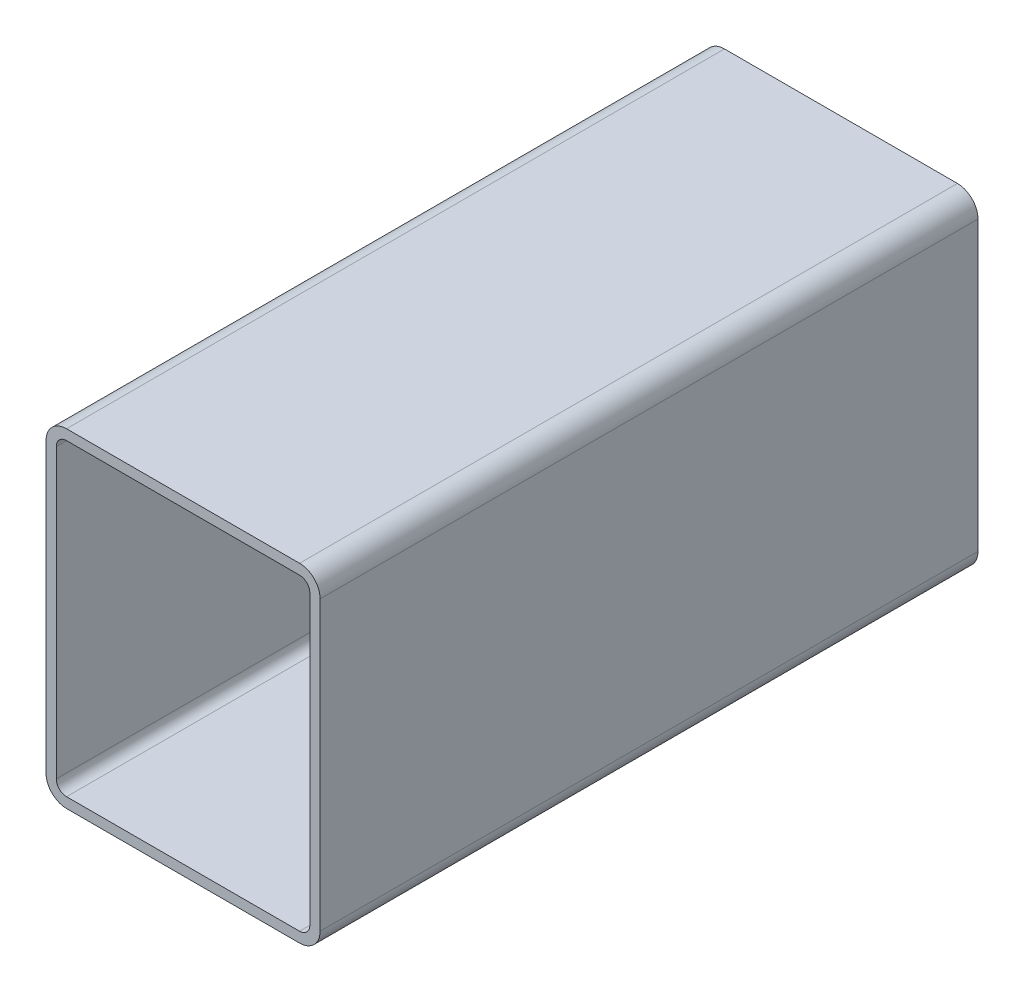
ISO-10303-21;
HEADER;
FILE_DESCRIPTION(('STEP AP214'),'2;1');
FILE_NAME('part.step','',(''),(''),'','','');
FILE_SCHEMA(('AUTOMOTIVE_DESIGN { 1 0 10303 214 1 1 1 1 }'));
ENDSEC;
DATA;
#1=APPLICATION_CONTEXT('core data for automotive mechanical design processes');
#2=APPLICATION_PROTOCOL_DEFINITION('international standard','automotive_design',2000,#1);
#3=PRODUCT_CONTEXT('',#1,'mechanical');
#4=PRODUCT('Part','Part','',(#3));
#5=PRODUCT_RELATED_PRODUCT_CATEGORY('part','',(#4));
#6=PRODUCT_DEFINITION_FORMATION('','',#4);
#7=PRODUCT_DEFINITION_CONTEXT('part definition',#1,'design');
#8=PRODUCT_DEFINITION('design','',#6,#7);
#9=PRODUCT_DEFINITION_SHAPE('','',#8);
#10=(LENGTH_UNIT() NAMED_UNIT(*) SI_UNIT(.MILLI.,.METRE.));
#11=(NAMED_UNIT(*) PLANE_ANGLE_UNIT() SI_UNIT($,.RADIAN.));
#12=(NAMED_UNIT(*) SI_UNIT($,.STERADIAN.) SOLID_ANGLE_UNIT());
#13=UNCERTAINTY_MEASURE_WITH_UNIT(LENGTH_MEASURE(1.E-05),#10,'distance_accuracy_value','');
#14=(GEOMETRIC_REPRESENTATION_CONTEXT(3) GLOBAL_UNCERTAINTY_ASSIGNED_CONTEXT((#13)) GLOBAL_UNIT_ASSIGNED_CONTEXT((#10,
#11,#12)) REPRESENTATION_CONTEXT('',''));
#15=CARTESIAN_POINT('',(0.,0.,0.));
#16=DIRECTION('',(0.,0.,1.));
#17=DIRECTION('',(1.,0.,0.));
#18=AXIS2_PLACEMENT_3D('',#15,#16,#17);
#19=CARTESIAN_POINT('',(10.3862396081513,144.886948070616,304.8));
#20=DIRECTION('',(0.,0.,1.));
#21=DIRECTION('',(1.,0.,0.));
#22=AXIS2_PLACEMENT_3D('',#19,#20,#21);
#23=PLANE('',#22);
#24=CARTESIAN_POINT('',(10.3862396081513,144.886948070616,304.8));
#25=DIRECTION('',(0.,0.,1.));
#26=DIRECTION('',(1.,0.,0.));
#27=AXIS2_PLACEMENT_3D('',#24,#25,#26);
#28=CIRCLE('',#27,9.52500000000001);
#29=CARTESIAN_POINT('',(10.3862396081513,154.411948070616,304.8));
#30=VERTEX_POINT('',#29);
#31=CARTESIAN_POINT('',(0.8612396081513,144.886948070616,304.8));
#32=VERTEX_POINT('',#31);
#33=EDGE_CURVE('E211',#30,#32,#28,.T.);
#34=ORIENTED_EDGE('',*,*,#33,.T.);
#35=DIRECTION('',(0.,-1.,0.));
#36=VECTOR('',#35,1.);
#37=CARTESIAN_POINT('',(0.8612396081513,11.5369480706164,304.8));
#38=LINE('',#37,#36);
#39=CARTESIAN_POINT('',(0.861239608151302,11.5369480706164,304.8));
#40=VERTEX_POINT('',#39);
#41=EDGE_CURVE('E214',#32,#40,#38,.T.);
#42=ORIENTED_EDGE('',*,*,#41,.T.);
#43=CARTESIAN_POINT('',(10.3862396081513,11.5369480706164,304.8));
#44=DIRECTION('',(0.,0.,1.));
#45=DIRECTION('',(1.,0.,0.));
#46=AXIS2_PLACEMENT_3D('',#43,#44,#45);
#47=CIRCLE('',#46,9.525);
#48=CARTESIAN_POINT('',(10.3862396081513,2.01194807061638,304.8));
#49=VERTEX_POINT('',#48);
#50=EDGE_CURVE('E217',#40,#49,#47,.T.);
#51=ORIENTED_EDGE('',*,*,#50,.T.);
#52=DIRECTION('',(1.,0.,0.));
#53=VECTOR('',#52,1.);
#54=CARTESIAN_POINT('',(118.336239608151,2.01194807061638,304.8));
#55=LINE('',#54,#53);
#56=CARTESIAN_POINT('',(118.336239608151,2.01194807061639,304.8));
#57=VERTEX_POINT('',#56);
#58=EDGE_CURVE('E219',#49,#57,#55,.T.);
#59=ORIENTED_EDGE('',*,*,#58,.T.);
#60=CARTESIAN_POINT('',(118.336239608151,11.5369480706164,304.8));
#61=DIRECTION('',(0.,0.,1.));
#62=DIRECTION('',(1.,0.,0.));
#63=AXIS2_PLACEMENT_3D('',#60,#61,#62);
#64=CIRCLE('',#63,9.525);
#65=CARTESIAN_POINT('',(127.861239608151,11.5369480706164,304.8));
#66=VERTEX_POINT('',#65);
#67=EDGE_CURVE('E221',#57,#66,#64,.T.);
#68=ORIENTED_EDGE('',*,*,#67,.T.);
#69=DIRECTION('',(0.,1.,0.));
#70=VECTOR('',#69,1.);
#71=CARTESIAN_POINT('',(127.861239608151,144.886948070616,304.8));
#72=LINE('',#71,#70);
#73=CARTESIAN_POINT('',(127.861239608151,144.886948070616,304.8));
#74=VERTEX_POINT('',#73);
#75=EDGE_CURVE('E223',#66,#74,#72,.T.);
#76=ORIENTED_EDGE('',*,*,#75,.T.);
#77=CARTESIAN_POINT('',(118.336239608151,144.886948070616,304.8));
#78=DIRECTION('',(0.,0.,1.));
#79=DIRECTION('',(1.,0.,0.));
#80=AXIS2_PLACEMENT_3D('',#77,#78,#79);
#81=CIRCLE('',#80,9.525);
#82=CARTESIAN_POINT('',(118.336239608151,154.411948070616,304.8));
#83=VERTEX_POINT('',#82);
#84=EDGE_CURVE('E225',#74,#83,#81,.T.);
#85=ORIENTED_EDGE('',*,*,#84,.T.);
#86=DIRECTION('',(-1.,0.,0.));
#87=VECTOR('',#86,1.);
#88=CARTESIAN_POINT('',(10.3862396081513,154.411948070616,304.8));
#89=LINE('',#88,#87);
#90=EDGE_CURVE('E227',#83,#30,#89,.T.);
#91=ORIENTED_EDGE('',*,*,#90,.T.);
#92=EDGE_LOOP('',(#34,#42,#51,#59,#68,#76,#85,#91));
#93=FACE_BOUND('',#92,.T.);
#94=DIRECTION('',(0.,-1.,0.));
#95=VECTOR('',#94,1.);
#96=CARTESIAN_POINT('',(5.6237396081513,11.5369480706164,304.8));
#97=LINE('',#96,#95);
#98=CARTESIAN_POINT('',(5.6237396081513,144.886948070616,304.8));
#99=VERTEX_POINT('',#98);
#100=CARTESIAN_POINT('',(5.6237396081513,11.5369480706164,304.8));
#101=VERTEX_POINT('',#100);
#102=EDGE_CURVE('E154',#99,#101,#97,.T.);
#103=ORIENTED_EDGE('',*,*,#102,.F.);
#104=CARTESIAN_POINT('',(10.3862396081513,144.886948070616,304.8));
#105=DIRECTION('',(0.,0.,1.));
#106=DIRECTION('',(1.,0.,0.));
#107=AXIS2_PLACEMENT_3D('',#104,#105,#106);
#108=CIRCLE('',#107,4.7625);
#109=CARTESIAN_POINT('',(10.3862396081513,149.649448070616,304.8));
#110=VERTEX_POINT('',#109);
#111=EDGE_CURVE('E146',#110,#99,#108,.T.);
#112=ORIENTED_EDGE('',*,*,#111,.F.);
#113=DIRECTION('',(-1.,0.,0.));
#114=VECTOR('',#113,1.);
#115=CARTESIAN_POINT('',(10.3862396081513,149.649448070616,304.8));
#116=LINE('',#115,#114);
#117=CARTESIAN_POINT('',(118.336239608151,149.649448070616,304.8));
#118=VERTEX_POINT('',#117);
#119=EDGE_CURVE('E179',#118,#110,#116,.T.);
#120=ORIENTED_EDGE('',*,*,#119,.F.);
#121=CARTESIAN_POINT('',(118.336239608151,144.886948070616,304.8));
#122=DIRECTION('',(0.,0.,1.));
#123=DIRECTION('',(1.,0.,0.));
#124=AXIS2_PLACEMENT_3D('',#121,#122,#123);
#125=CIRCLE('',#124,4.7625);
#126=CARTESIAN_POINT('',(123.098739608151,144.886948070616,304.8));
#127=VERTEX_POINT('',#126);
#128=EDGE_CURVE('E177',#127,#118,#125,.T.);
#129=ORIENTED_EDGE('',*,*,#128,.F.);
#130=DIRECTION('',(0.,1.,0.));
#131=VECTOR('',#130,1.);
#132=CARTESIAN_POINT('',(123.098739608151,144.886948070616,304.8));
#133=LINE('',#132,#131);
#134=CARTESIAN_POINT('',(123.098739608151,11.5369480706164,304.8));
#135=VERTEX_POINT('',#134);
#136=EDGE_CURVE('E175',#135,#127,#133,.T.);
#137=ORIENTED_EDGE('',*,*,#136,.F.);
#138=CARTESIAN_POINT('',(118.336239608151,11.5369480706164,304.8));
#139=DIRECTION('',(0.,0.,1.));
#140=DIRECTION('',(1.,0.,0.));
#141=AXIS2_PLACEMENT_3D('',#138,#139,#140);
#142=CIRCLE('',#141,4.7625);
#143=CARTESIAN_POINT('',(118.336239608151,6.77444807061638,304.8));
#144=VERTEX_POINT('',#143);
#145=EDGE_CURVE('E173',#144,#135,#142,.T.);
#146=ORIENTED_EDGE('',*,*,#145,.F.);
#147=DIRECTION('',(1.,0.,0.));
#148=VECTOR('',#147,1.);
#149=CARTESIAN_POINT('',(118.336239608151,6.77444807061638,304.8));
#150=LINE('',#149,#148);
#151=CARTESIAN_POINT('',(10.3862396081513,6.77444807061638,304.8));
#152=VERTEX_POINT('',#151);
#153=EDGE_CURVE('E169',#152,#144,#150,.T.);
#154=ORIENTED_EDGE('',*,*,#153,.F.);
#155=CARTESIAN_POINT('',(10.3862396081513,11.5369480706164,304.8));
#156=DIRECTION('',(0.,0.,1.));
#157=DIRECTION('',(1.,0.,0.));
#158=AXIS2_PLACEMENT_3D('',#155,#156,#157);
#159=CIRCLE('',#158,4.7625);
#160=EDGE_CURVE('E167',#101,#152,#159,.T.);
#161=ORIENTED_EDGE('',*,*,#160,.F.);
#162=EDGE_LOOP('',(#103,#112,#120,#129,#137,#146,#154,#161));
#163=FACE_BOUND('',#162,.T.);
#164=ADVANCED_FACE('F33',(#93,#163),#23,.T.);
#165=CARTESIAN_POINT('',(10.3862396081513,144.886948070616,0.));
#166=DIRECTION('',(0.,0.,1.));
#167=DIRECTION('',(1.,0.,0.));
#168=AXIS2_PLACEMENT_3D('',#165,#166,#167);
#169=PLANE('',#168);
#170=CARTESIAN_POINT('',(10.3862396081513,144.886948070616,0.));
#171=DIRECTION('',(0.,0.,1.));
#172=DIRECTION('',(1.,0.,0.));
#173=AXIS2_PLACEMENT_3D('',#170,#171,#172);
#174=CIRCLE('',#173,9.52500000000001);
#175=CARTESIAN_POINT('',(10.3862396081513,154.411948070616,0.));
#176=VERTEX_POINT('',#175);
#177=CARTESIAN_POINT('',(0.8612396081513,144.886948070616,0.));
#178=VERTEX_POINT('',#177);
#179=EDGE_CURVE('E162',#176,#178,#174,.T.);
#180=ORIENTED_EDGE('',*,*,#179,.F.);
#181=DIRECTION('',(-1.,0.,0.));
#182=VECTOR('',#181,1.);
#183=CARTESIAN_POINT('',(10.3862396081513,154.411948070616,0.));
#184=LINE('',#183,#182);
#185=CARTESIAN_POINT('',(118.336239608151,154.411948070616,0.));
#186=VERTEX_POINT('',#185);
#187=EDGE_CURVE('E215',#186,#176,#184,.T.);
#188=ORIENTED_EDGE('',*,*,#187,.F.);
#189=CARTESIAN_POINT('',(118.336239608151,144.886948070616,0.));
#190=DIRECTION('',(0.,0.,1.));
#191=DIRECTION('',(1.,0.,0.));
#192=AXIS2_PLACEMENT_3D('',#189,#190,#191);
#193=CIRCLE('',#192,9.525);
#194=CARTESIAN_POINT('',(127.861239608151,144.886948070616,0.));
#195=VERTEX_POINT('',#194);
#196=EDGE_CURVE('E242',#195,#186,#193,.T.);
#197=ORIENTED_EDGE('',*,*,#196,.F.);
#198=DIRECTION('',(0.,1.,0.));
#199=VECTOR('',#198,1.);
#200=CARTESIAN_POINT('',(127.861239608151,144.886948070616,0.));
#201=LINE('',#200,#199);
#202=CARTESIAN_POINT('',(127.861239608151,11.5369480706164,0.));
#203=VERTEX_POINT('',#202);
#204=EDGE_CURVE('E240',#203,#195,#201,.T.);
#205=ORIENTED_EDGE('',*,*,#204,.F.);
#206=CARTESIAN_POINT('',(118.336239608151,11.5369480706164,0.));
#207=DIRECTION('',(0.,0.,1.));
#208=DIRECTION('',(1.,0.,0.));
#209=AXIS2_PLACEMENT_3D('',#206,#207,#208);
#210=CIRCLE('',#209,9.525);
#211=CARTESIAN_POINT('',(118.336239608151,2.01194807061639,0.));
#212=VERTEX_POINT('',#211);
#213=EDGE_CURVE('E238',#212,#203,#210,.T.);
#214=ORIENTED_EDGE('',*,*,#213,.F.);
#215=DIRECTION('',(1.,0.,0.));
#216=VECTOR('',#215,1.);
#217=CARTESIAN_POINT('',(118.336239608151,2.01194807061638,0.));
#218=LINE('',#217,#216);
#219=CARTESIAN_POINT('',(10.3862396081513,2.01194807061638,0.));
#220=VERTEX_POINT('',#219);
#221=EDGE_CURVE('E236',#220,#212,#218,.T.);
#222=ORIENTED_EDGE('',*,*,#221,.F.);
#223=CARTESIAN_POINT('',(10.3862396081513,11.5369480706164,0.));
#224=DIRECTION('',(0.,0.,1.));
#225=DIRECTION('',(1.,0.,0.));
#226=AXIS2_PLACEMENT_3D('',#223,#224,#225);
#227=CIRCLE('',#226,9.525);
#228=CARTESIAN_POINT('',(0.861239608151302,11.5369480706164,0.));
#229=VERTEX_POINT('',#228);
#230=EDGE_CURVE('E234',#229,#220,#227,.T.);
#231=ORIENTED_EDGE('',*,*,#230,.F.);
#232=DIRECTION('',(0.,-1.,0.));
#233=VECTOR('',#232,1.);
#234=CARTESIAN_POINT('',(0.8612396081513,11.5369480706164,0.));
#235=LINE('',#234,#233);
#236=EDGE_CURVE('E232',#178,#229,#235,.T.);
#237=ORIENTED_EDGE('',*,*,#236,.F.);
#238=EDGE_LOOP('',(#180,#188,#197,#205,#214,#222,#231,#237));
#239=FACE_BOUND('',#238,.T.);
#240=CARTESIAN_POINT('',(10.3862396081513,144.886948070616,0.));
#241=DIRECTION('',(0.,0.,1.));
#242=DIRECTION('',(1.,0.,0.));
#243=AXIS2_PLACEMENT_3D('',#240,#241,#242);
#244=CIRCLE('',#243,4.7625);
#245=CARTESIAN_POINT('',(10.3862396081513,149.649448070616,0.));
#246=VERTEX_POINT('',#245);
#247=CARTESIAN_POINT('',(5.6237396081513,144.886948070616,0.));
#248=VERTEX_POINT('',#247);
#249=EDGE_CURVE('E56',#246,#248,#244,.T.);
#250=ORIENTED_EDGE('',*,*,#249,.T.);
#251=DIRECTION('',(0.,-1.,0.));
#252=VECTOR('',#251,1.);
#253=CARTESIAN_POINT('',(5.6237396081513,11.5369480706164,0.));
#254=LINE('',#253,#252);
#255=CARTESIAN_POINT('',(5.6237396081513,11.5369480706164,0.));
#256=VERTEX_POINT('',#255);
#257=EDGE_CURVE('E161',#248,#256,#254,.T.);
#258=ORIENTED_EDGE('',*,*,#257,.T.);
#259=CARTESIAN_POINT('',(10.3862396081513,11.5369480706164,0.));
#260=DIRECTION('',(0.,0.,1.));
#261=DIRECTION('',(1.,0.,0.));
#262=AXIS2_PLACEMENT_3D('',#259,#260,#261);
#263=CIRCLE('',#262,4.7625);
#264=CARTESIAN_POINT('',(10.3862396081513,6.77444807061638,0.));
#265=VERTEX_POINT('',#264);
#266=EDGE_CURVE('E183',#256,#265,#263,.T.);
#267=ORIENTED_EDGE('',*,*,#266,.T.);
#268=DIRECTION('',(1.,0.,0.));
#269=VECTOR('',#268,1.);
#270=CARTESIAN_POINT('',(118.336239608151,6.77444807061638,0.));
#271=LINE('',#270,#269);
#272=CARTESIAN_POINT('',(118.336239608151,6.77444807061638,0.));
#273=VERTEX_POINT('',#272);
#274=EDGE_CURVE('E186',#265,#273,#271,.T.);
#275=ORIENTED_EDGE('',*,*,#274,.T.);
#276=CARTESIAN_POINT('',(118.336239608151,11.5369480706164,0.));
#277=DIRECTION('',(0.,0.,1.));
#278=DIRECTION('',(1.,0.,0.));
#279=AXIS2_PLACEMENT_3D('',#276,#277,#278);
#280=CIRCLE('',#279,4.7625);
#281=CARTESIAN_POINT('',(123.098739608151,11.5369480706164,0.));
#282=VERTEX_POINT('',#281);
#283=EDGE_CURVE('E189',#273,#282,#280,.T.);
#284=ORIENTED_EDGE('',*,*,#283,.T.);
#285=DIRECTION('',(0.,1.,0.));
#286=VECTOR('',#285,1.);
#287=CARTESIAN_POINT('',(123.098739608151,144.886948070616,0.));
#288=LINE('',#287,#286);
#289=CARTESIAN_POINT('',(123.098739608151,144.886948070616,0.));
#290=VERTEX_POINT('',#289);
#291=EDGE_CURVE('E192',#282,#290,#288,.T.);
#292=ORIENTED_EDGE('',*,*,#291,.T.);
#293=CARTESIAN_POINT('',(118.336239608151,144.886948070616,0.));
#294=DIRECTION('',(0.,0.,1.));
#295=DIRECTION('',(1.,0.,0.));
#296=AXIS2_PLACEMENT_3D('',#293,#294,#295);
#297=CIRCLE('',#296,4.7625);
#298=CARTESIAN_POINT('',(118.336239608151,149.649448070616,0.));
#299=VERTEX_POINT('',#298);
#300=EDGE_CURVE('E195',#290,#299,#297,.T.);
#301=ORIENTED_EDGE('',*,*,#300,.T.);
#302=DIRECTION('',(-1.,0.,0.));
#303=VECTOR('',#302,1.);
#304=CARTESIAN_POINT('',(10.3862396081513,149.649448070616,0.));
#305=LINE('',#304,#303);
#306=EDGE_CURVE('E155',#299,#246,#305,.T.);
#307=ORIENTED_EDGE('',*,*,#306,.T.);
#308=EDGE_LOOP('',(#250,#258,#267,#275,#284,#292,#301,#307));
#309=FACE_BOUND('',#308,.T.);
#310=ADVANCED_FACE('F272',(#239,#309),#169,.F.);
#311=CARTESIAN_POINT('',(10.3862396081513,144.886948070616,304.8));
#312=DIRECTION('',(0.,0.,-1.));
#313=DIRECTION('',(-1.,0.,0.));
#314=AXIS2_PLACEMENT_3D('',#311,#312,#313);
#315=CYLINDRICAL_SURFACE('',#314,9.52500000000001);
#316=ORIENTED_EDGE('',*,*,#179,.T.);
#317=DIRECTION('',(0.,0.,-1.));
#318=VECTOR('',#317,1.);
#319=CARTESIAN_POINT('',(0.8612396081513,144.886948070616,304.8));
#320=LINE('',#319,#318);
#321=EDGE_CURVE('E11',#32,#178,#320,.T.);
#322=ORIENTED_EDGE('',*,*,#321,.F.);
#323=ORIENTED_EDGE('',*,*,#33,.F.);
#324=DIRECTION('',(0.,0.,-1.));
#325=VECTOR('',#324,1.);
#326=CARTESIAN_POINT('',(10.3862396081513,154.411948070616,304.8));
#327=LINE('',#326,#325);
#328=EDGE_CURVE('E229',#30,#176,#327,.T.);
#329=ORIENTED_EDGE('',*,*,#328,.T.);
#330=EDGE_LOOP('',(#316,#322,#323,#329));
#331=FACE_BOUND('',#330,.T.);
#332=ADVANCED_FACE('F35',(#331),#315,.T.);
#333=CARTESIAN_POINT('',(0.8612396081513,11.5369480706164,304.8));
#334=DIRECTION('',(1.,0.,0.));
#335=DIRECTION('',(0.,0.,-1.));
#336=AXIS2_PLACEMENT_3D('',#333,#334,#335);
#337=PLANE('',#336);
#338=ORIENTED_EDGE('',*,*,#236,.T.);
#339=DIRECTION('',(0.,0.,-1.));
#340=VECTOR('',#339,1.);
#341=CARTESIAN_POINT('',(0.861239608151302,11.5369480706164,304.8));
#342=LINE('',#341,#340);
#343=EDGE_CURVE('E41',#40,#229,#342,.T.);
#344=ORIENTED_EDGE('',*,*,#343,.F.);
#345=ORIENTED_EDGE('',*,*,#41,.F.);
#346=ORIENTED_EDGE('',*,*,#321,.T.);
#347=EDGE_LOOP('',(#338,#344,#345,#346));
#348=FACE_BOUND('',#347,.T.);
#349=ADVANCED_FACE('F289',(#348),#337,.F.);
#350=CARTESIAN_POINT('',(10.3862396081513,11.5369480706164,304.8));
#351=DIRECTION('',(0.,0.,-1.));
#352=DIRECTION('',(-1.,0.,0.));
#353=AXIS2_PLACEMENT_3D('',#350,#351,#352);
#354=CYLINDRICAL_SURFACE('',#353,9.525);
#355=ORIENTED_EDGE('',*,*,#230,.T.);
#356=DIRECTION('',(0.,0.,-1.));
#357=VECTOR('',#356,1.);
#358=CARTESIAN_POINT('',(10.3862396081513,2.01194807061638,304.8));
#359=LINE('',#358,#357);
#360=EDGE_CURVE('E259',#49,#220,#359,.T.);
#361=ORIENTED_EDGE('',*,*,#360,.F.);
#362=ORIENTED_EDGE('',*,*,#50,.F.);
#363=ORIENTED_EDGE('',*,*,#343,.T.);
#364=EDGE_LOOP('',(#355,#361,#362,#363));
#365=FACE_BOUND('',#364,.T.);
#366=ADVANCED_FACE('F266',(#365),#354,.T.);
#367=CARTESIAN_POINT('',(118.336239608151,2.01194807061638,304.8));
#368=DIRECTION('',(0.,1.,0.));
#369=DIRECTION('',(0.,0.,1.));
#370=AXIS2_PLACEMENT_3D('',#367,#368,#369);
#371=PLANE('',#370);
#372=ORIENTED_EDGE('',*,*,#221,.T.);
#373=DIRECTION('',(0.,0.,-1.));
#374=VECTOR('',#373,1.);
#375=CARTESIAN_POINT('',(118.336239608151,2.01194807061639,304.8));
#376=LINE('',#375,#374);
#377=EDGE_CURVE('E256',#57,#212,#376,.T.);
#378=ORIENTED_EDGE('',*,*,#377,.F.);
#379=ORIENTED_EDGE('',*,*,#58,.F.);
#380=ORIENTED_EDGE('',*,*,#360,.T.);
#381=EDGE_LOOP('',(#372,#378,#379,#380));
#382=FACE_BOUND('',#381,.T.);
#383=ADVANCED_FACE('F278',(#382),#371,.F.);
#384=CARTESIAN_POINT('',(118.336239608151,11.5369480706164,304.8));
#385=DIRECTION('',(0.,0.,-1.));
#386=DIRECTION('',(-1.,0.,0.));
#387=AXIS2_PLACEMENT_3D('',#384,#385,#386);
#388=CYLINDRICAL_SURFACE('',#387,9.525);
#389=ORIENTED_EDGE('',*,*,#213,.T.);
#390=DIRECTION('',(0.,0.,-1.));
#391=VECTOR('',#390,1.);
#392=CARTESIAN_POINT('',(127.861239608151,11.5369480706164,304.8));
#393=LINE('',#392,#391);
#394=EDGE_CURVE('E253',#66,#203,#393,.T.);
#395=ORIENTED_EDGE('',*,*,#394,.F.);
#396=ORIENTED_EDGE('',*,*,#67,.F.);
#397=ORIENTED_EDGE('',*,*,#377,.T.);
#398=EDGE_LOOP('',(#389,#395,#396,#397));
#399=FACE_BOUND('',#398,.T.);
#400=ADVANCED_FACE('F282',(#399),#388,.T.);
#401=CARTESIAN_POINT('',(127.861239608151,144.886948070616,304.8));
#402=DIRECTION('',(-1.,0.,0.));
#403=DIRECTION('',(0.,0.,1.));
#404=AXIS2_PLACEMENT_3D('',#401,#402,#403);
#405=PLANE('',#404);
#406=ORIENTED_EDGE('',*,*,#204,.T.);
#407=DIRECTION('',(0.,0.,-1.));
#408=VECTOR('',#407,1.);
#409=CARTESIAN_POINT('',(127.861239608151,144.886948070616,304.8));
#410=LINE('',#409,#408);
#411=EDGE_CURVE('E250',#74,#195,#410,.T.);
#412=ORIENTED_EDGE('',*,*,#411,.F.);
#413=ORIENTED_EDGE('',*,*,#75,.F.);
#414=ORIENTED_EDGE('',*,*,#394,.T.);
#415=EDGE_LOOP('',(#406,#412,#413,#414));
#416=FACE_BOUND('',#415,.T.);
#417=ADVANCED_FACE('F302',(#416),#405,.F.);
#418=CARTESIAN_POINT('',(118.336239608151,144.886948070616,304.8));
#419=DIRECTION('',(0.,0.,-1.));
#420=DIRECTION('',(-1.,0.,0.));
#421=AXIS2_PLACEMENT_3D('',#418,#419,#420);
#422=CYLINDRICAL_SURFACE('',#421,9.525);
#423=ORIENTED_EDGE('',*,*,#196,.T.);
#424=DIRECTION('',(0.,0.,-1.));
#425=VECTOR('',#424,1.);
#426=CARTESIAN_POINT('',(118.336239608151,154.411948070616,304.8));
#427=LINE('',#426,#425);
#428=EDGE_CURVE('E247',#83,#186,#427,.T.);
#429=ORIENTED_EDGE('',*,*,#428,.F.);
#430=ORIENTED_EDGE('',*,*,#84,.F.);
#431=ORIENTED_EDGE('',*,*,#411,.T.);
#432=EDGE_LOOP('',(#423,#429,#430,#431));
#433=FACE_BOUND('',#432,.T.);
#434=ADVANCED_FACE('F300',(#433),#422,.T.);
#435=CARTESIAN_POINT('',(10.3862396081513,154.411948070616,304.8));
#436=DIRECTION('',(0.,-1.,0.));
#437=DIRECTION('',(0.,0.,-1.));
#438=AXIS2_PLACEMENT_3D('',#435,#436,#437);
#439=PLANE('',#438);
#440=ORIENTED_EDGE('',*,*,#187,.T.);
#441=ORIENTED_EDGE('',*,*,#328,.F.);
#442=ORIENTED_EDGE('',*,*,#90,.F.);
#443=ORIENTED_EDGE('',*,*,#428,.T.);
#444=EDGE_LOOP('',(#440,#441,#442,#443));
#445=FACE_BOUND('',#444,.T.);
#446=ADVANCED_FACE('F295',(#445),#439,.F.);
#447=CARTESIAN_POINT('',(10.3862396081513,144.886948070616,304.8));
#448=DIRECTION('',(0.,0.,-1.));
#449=DIRECTION('',(-1.,0.,0.));
#450=AXIS2_PLACEMENT_3D('',#447,#448,#449);
#451=CYLINDRICAL_SURFACE('',#450,4.7625);
#452=ORIENTED_EDGE('',*,*,#249,.F.);
#453=DIRECTION('',(0.,0.,-1.));
#454=VECTOR('',#453,1.);
#455=CARTESIAN_POINT('',(10.3862396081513,149.649448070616,304.8));
#456=LINE('',#455,#454);
#457=EDGE_CURVE('E150',#110,#246,#456,.T.);
#458=ORIENTED_EDGE('',*,*,#457,.F.);
#459=ORIENTED_EDGE('',*,*,#111,.T.);
#460=DIRECTION('',(0.,0.,-1.));
#461=VECTOR('',#460,1.);
#462=CARTESIAN_POINT('',(5.6237396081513,144.886948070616,304.8));
#463=LINE('',#462,#461);
#464=EDGE_CURVE('E149',#99,#248,#463,.T.);
#465=ORIENTED_EDGE('',*,*,#464,.T.);
#466=EDGE_LOOP('',(#452,#458,#459,#465));
#467=FACE_BOUND('',#466,.T.);
#468=ADVANCED_FACE('F148',(#467),#451,.F.);
#469=CARTESIAN_POINT('',(5.6237396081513,11.5369480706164,304.8));
#470=DIRECTION('',(1.,0.,0.));
#471=DIRECTION('',(0.,0.,-1.));
#472=AXIS2_PLACEMENT_3D('',#469,#470,#471);
#473=PLANE('',#472);
#474=ORIENTED_EDGE('',*,*,#257,.F.);
#475=ORIENTED_EDGE('',*,*,#464,.F.);
#476=ORIENTED_EDGE('',*,*,#102,.T.);
#477=DIRECTION('',(0.,0.,-1.));
#478=VECTOR('',#477,1.);
#479=CARTESIAN_POINT('',(5.6237396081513,11.5369480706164,304.8));
#480=LINE('',#479,#478);
#481=EDGE_CURVE('E163',#101,#256,#480,.T.);
#482=ORIENTED_EDGE('',*,*,#481,.T.);
#483=EDGE_LOOP('',(#474,#475,#476,#482));
#484=FACE_BOUND('',#483,.T.);
#485=ADVANCED_FACE('F158',(#484),#473,.T.);
#486=CARTESIAN_POINT('',(10.3862396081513,11.5369480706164,304.8));
#487=DIRECTION('',(0.,0.,-1.));
#488=DIRECTION('',(-1.,0.,0.));
#489=AXIS2_PLACEMENT_3D('',#486,#487,#488);
#490=CYLINDRICAL_SURFACE('',#489,4.7625);
#491=ORIENTED_EDGE('',*,*,#266,.F.);
#492=ORIENTED_EDGE('',*,*,#481,.F.);
#493=ORIENTED_EDGE('',*,*,#160,.T.);
#494=DIRECTION('',(0.,0.,-1.));
#495=VECTOR('',#494,1.);
#496=CARTESIAN_POINT('',(10.3862396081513,6.77444807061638,304.8));
#497=LINE('',#496,#495);
#498=EDGE_CURVE('E208',#152,#265,#497,.T.);
#499=ORIENTED_EDGE('',*,*,#498,.T.);
#500=EDGE_LOOP('',(#491,#492,#493,#499));
#501=FACE_BOUND('',#500,.T.);
#502=ADVANCED_FACE('F327',(#501),#490,.F.);
#503=CARTESIAN_POINT('',(118.336239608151,6.77444807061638,304.8));
#504=DIRECTION('',(0.,1.,0.));
#505=DIRECTION('',(0.,0.,1.));
#506=AXIS2_PLACEMENT_3D('',#503,#504,#505);
#507=PLANE('',#506);
#508=ORIENTED_EDGE('',*,*,#274,.F.);
#509=ORIENTED_EDGE('',*,*,#498,.F.);
#510=ORIENTED_EDGE('',*,*,#153,.T.);
#511=DIRECTION('',(0.,0.,-1.));
#512=VECTOR('',#511,1.);
#513=CARTESIAN_POINT('',(118.336239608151,6.77444807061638,304.8));
#514=LINE('',#513,#512);
#515=EDGE_CURVE('E206',#144,#273,#514,.T.);
#516=ORIENTED_EDGE('',*,*,#515,.T.);
#517=EDGE_LOOP('',(#508,#509,#510,#516));
#518=FACE_BOUND('',#517,.T.);
#519=ADVANCED_FACE('F331',(#518),#507,.T.);
#520=CARTESIAN_POINT('',(118.336239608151,11.5369480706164,304.8));
#521=DIRECTION('',(0.,0.,-1.));
#522=DIRECTION('',(-1.,0.,0.));
#523=AXIS2_PLACEMENT_3D('',#520,#521,#522);
#524=CYLINDRICAL_SURFACE('',#523,4.7625);
#525=ORIENTED_EDGE('',*,*,#283,.F.);
#526=ORIENTED_EDGE('',*,*,#515,.F.);
#527=ORIENTED_EDGE('',*,*,#145,.T.);
#528=DIRECTION('',(0.,0.,-1.));
#529=VECTOR('',#528,1.);
#530=CARTESIAN_POINT('',(123.098739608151,11.5369480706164,304.8));
#531=LINE('',#530,#529);
#532=EDGE_CURVE('E204',#135,#282,#531,.T.);
#533=ORIENTED_EDGE('',*,*,#532,.T.);
#534=EDGE_LOOP('',(#525,#526,#527,#533));
#535=FACE_BOUND('',#534,.T.);
#536=ADVANCED_FACE('F337',(#535),#524,.F.);
#537=CARTESIAN_POINT('',(123.098739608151,144.886948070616,304.8));
#538=DIRECTION('',(-1.,0.,0.));
#539=DIRECTION('',(0.,0.,1.));
#540=AXIS2_PLACEMENT_3D('',#537,#538,#539);
#541=PLANE('',#540);
#542=ORIENTED_EDGE('',*,*,#291,.F.);
#543=ORIENTED_EDGE('',*,*,#532,.F.);
#544=ORIENTED_EDGE('',*,*,#136,.T.);
#545=DIRECTION('',(0.,0.,-1.));
#546=VECTOR('',#545,1.);
#547=CARTESIAN_POINT('',(123.098739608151,144.886948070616,304.8));
#548=LINE('',#547,#546);
#549=EDGE_CURVE('E202',#127,#290,#548,.T.);
#550=ORIENTED_EDGE('',*,*,#549,.T.);
#551=EDGE_LOOP('',(#542,#543,#544,#550));
#552=FACE_BOUND('',#551,.T.);
#553=ADVANCED_FACE('F341',(#552),#541,.T.);
#554=CARTESIAN_POINT('',(118.336239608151,144.886948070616,304.8));
#555=DIRECTION('',(0.,0.,-1.));
#556=DIRECTION('',(-1.,0.,0.));
#557=AXIS2_PLACEMENT_3D('',#554,#555,#556);
#558=CYLINDRICAL_SURFACE('',#557,4.7625);
#559=ORIENTED_EDGE('',*,*,#300,.F.);
#560=ORIENTED_EDGE('',*,*,#549,.F.);
#561=ORIENTED_EDGE('',*,*,#128,.T.);
#562=DIRECTION('',(0.,0.,-1.));
#563=VECTOR('',#562,1.);
#564=CARTESIAN_POINT('',(118.336239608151,149.649448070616,304.8));
#565=LINE('',#564,#563);
#566=EDGE_CURVE('E48',#118,#299,#565,.T.);
#567=ORIENTED_EDGE('',*,*,#566,.T.);
#568=EDGE_LOOP('',(#559,#560,#561,#567));
#569=FACE_BOUND('',#568,.T.);
#570=ADVANCED_FACE('F345',(#569),#558,.F.);
#571=CARTESIAN_POINT('',(10.3862396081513,149.649448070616,304.8));
#572=DIRECTION('',(0.,-1.,0.));
#573=DIRECTION('',(0.,0.,-1.));
#574=AXIS2_PLACEMENT_3D('',#571,#572,#573);
#575=PLANE('',#574);
#576=ORIENTED_EDGE('',*,*,#306,.F.);
#577=ORIENTED_EDGE('',*,*,#566,.F.);
#578=ORIENTED_EDGE('',*,*,#119,.T.);
#579=ORIENTED_EDGE('',*,*,#457,.T.);
#580=EDGE_LOOP('',(#576,#577,#578,#579));
#581=FACE_BOUND('',#580,.T.);
#582=ADVANCED_FACE('F349',(#581),#575,.T.);
#583=CLOSED_SHELL('',(#164,#310,#332,#349,#366,#383,#400,#417,#434,#446,#468,#485,#502,#519,
#536,#553,#570,#582));
#584=MANIFOLD_SOLID_BREP('B2',#583);
#585=ADVANCED_BREP_SHAPE_REPRESENTATION('',(#18,#584),#14);
#586=SHAPE_DEFINITION_REPRESENTATION(#9,#585);
ENDSEC;
END-ISO-10303-21;
